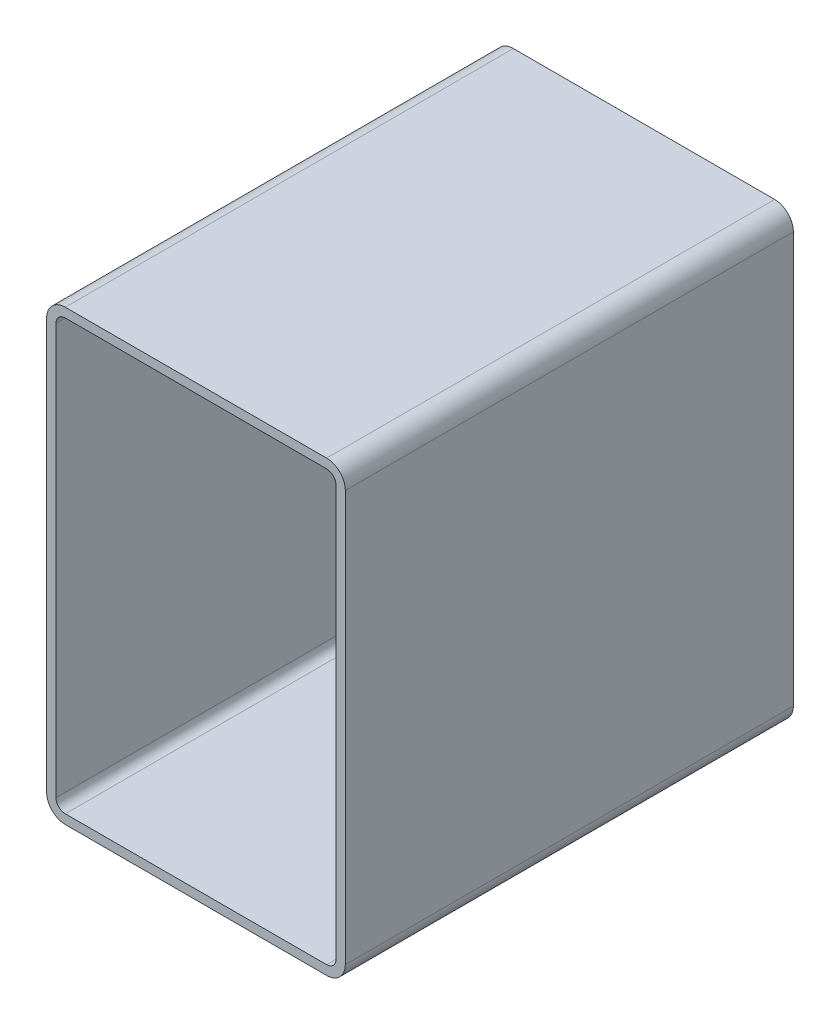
ISO-10303-21;
HEADER;
FILE_DESCRIPTION(('STEP AP214'),'2;1');
FILE_NAME('part.step','',(''),(''),'','','');
FILE_SCHEMA(('AUTOMOTIVE_DESIGN { 1 0 10303 214 1 1 1 1 }'));
ENDSEC;
DATA;
#1=APPLICATION_CONTEXT('core data for automotive mechanical design processes');
#2=APPLICATION_PROTOCOL_DEFINITION('international standard','automotive_design',2000,#1);
#3=PRODUCT_CONTEXT('',#1,'mechanical');
#4=PRODUCT('Part','Part','',(#3));
#5=PRODUCT_RELATED_PRODUCT_CATEGORY('part','',(#4));
#6=PRODUCT_DEFINITION_FORMATION('','',#4);
#7=PRODUCT_DEFINITION_CONTEXT('part definition',#1,'design');
#8=PRODUCT_DEFINITION('design','',#6,#7);
#9=PRODUCT_DEFINITION_SHAPE('','',#8);
#10=(LENGTH_UNIT() NAMED_UNIT(*) SI_UNIT(.MILLI.,.METRE.));
#11=(NAMED_UNIT(*) PLANE_ANGLE_UNIT() SI_UNIT($,.RADIAN.));
#12=(NAMED_UNIT(*) SI_UNIT($,.STERADIAN.) SOLID_ANGLE_UNIT());
#13=UNCERTAINTY_MEASURE_WITH_UNIT(LENGTH_MEASURE(1.E-05),#10,'distance_accuracy_value','');
#14=(GEOMETRIC_REPRESENTATION_CONTEXT(3) GLOBAL_UNCERTAINTY_ASSIGNED_CONTEXT((#13)) GLOBAL_UNIT_ASSIGNED_CONTEXT((#10,
#11,#12)) REPRESENTATION_CONTEXT('',''));
#15=CARTESIAN_POINT('',(0.,0.,0.));
#16=DIRECTION('',(0.,0.,1.));
#17=DIRECTION('',(1.,0.,0.));
#18=AXIS2_PLACEMENT_3D('',#15,#16,#17);
#19=CARTESIAN_POINT('',(14.0909404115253,293.974496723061,304.8));
#20=DIRECTION('',(0.,0.,1.));
#21=DIRECTION('',(1.,0.,0.));
#22=AXIS2_PLACEMENT_3D('',#19,#20,#21);
#23=PLANE('',#22);
#24=CARTESIAN_POINT('',(14.0909404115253,293.974496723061,304.8));
#25=DIRECTION('',(0.,0.,1.));
#26=DIRECTION('',(1.,0.,0.));
#27=AXIS2_PLACEMENT_3D('',#24,#25,#26);
#28=CIRCLE('',#27,12.7);
#29=CARTESIAN_POINT('',(14.0909404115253,306.674496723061,304.8));
#30=VERTEX_POINT('',#29);
#31=CARTESIAN_POINT('',(1.3909404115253,293.974496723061,304.8));
#32=VERTEX_POINT('',#31);
#33=EDGE_CURVE('E211',#30,#32,#28,.T.);
#34=ORIENTED_EDGE('',*,*,#33,.T.);
#35=DIRECTION('',(0.,-1.,0.));
#36=VECTOR('',#35,1.);
#37=CARTESIAN_POINT('',(1.3909404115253,14.5744967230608,304.8));
#38=LINE('',#37,#36);
#39=CARTESIAN_POINT('',(1.3909404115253,14.5744967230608,304.8));
#40=VERTEX_POINT('',#39);
#41=EDGE_CURVE('E214',#32,#40,#38,.T.);
#42=ORIENTED_EDGE('',*,*,#41,.T.);
#43=CARTESIAN_POINT('',(14.0909404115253,14.5744967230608,304.8));
#44=DIRECTION('',(0.,0.,1.));
#45=DIRECTION('',(1.,0.,0.));
#46=AXIS2_PLACEMENT_3D('',#43,#44,#45);
#47=CIRCLE('',#46,12.7);
#48=CARTESIAN_POINT('',(14.0909404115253,1.87449672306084,304.8));
#49=VERTEX_POINT('',#48);
#50=EDGE_CURVE('E217',#40,#49,#47,.T.);
#51=ORIENTED_EDGE('',*,*,#50,.T.);
#52=DIRECTION('',(1.,0.,0.));
#53=VECTOR('',#52,1.);
#54=CARTESIAN_POINT('',(191.890940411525,1.87449672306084,304.8));
#55=LINE('',#54,#53);
#56=CARTESIAN_POINT('',(191.890940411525,1.87449672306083,304.8));
#57=VERTEX_POINT('',#56);
#58=EDGE_CURVE('E219',#49,#57,#55,.T.);
#59=ORIENTED_EDGE('',*,*,#58,.T.);
#60=CARTESIAN_POINT('',(191.890940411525,14.5744967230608,304.8));
#61=DIRECTION('',(0.,0.,1.));
#62=DIRECTION('',(1.,0.,0.));
#63=AXIS2_PLACEMENT_3D('',#60,#61,#62);
#64=CIRCLE('',#63,12.7);
#65=CARTESIAN_POINT('',(204.590940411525,14.5744967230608,304.8));
#66=VERTEX_POINT('',#65);
#67=EDGE_CURVE('E221',#57,#66,#64,.T.);
#68=ORIENTED_EDGE('',*,*,#67,.T.);
#69=DIRECTION('',(0.,1.,0.));
#70=VECTOR('',#69,1.);
#71=CARTESIAN_POINT('',(204.590940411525,293.974496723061,304.8));
#72=LINE('',#71,#70);
#73=CARTESIAN_POINT('',(204.590940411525,293.974496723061,304.8));
#74=VERTEX_POINT('',#73);
#75=EDGE_CURVE('E223',#66,#74,#72,.T.);
#76=ORIENTED_EDGE('',*,*,#75,.T.);
#77=CARTESIAN_POINT('',(191.890940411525,293.974496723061,304.8));
#78=DIRECTION('',(0.,0.,1.));
#79=DIRECTION('',(1.,0.,0.));
#80=AXIS2_PLACEMENT_3D('',#77,#78,#79);
#81=CIRCLE('',#80,12.7);
#82=CARTESIAN_POINT('',(191.890940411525,306.674496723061,304.8));
#83=VERTEX_POINT('',#82);
#84=EDGE_CURVE('E225',#74,#83,#81,.T.);
#85=ORIENTED_EDGE('',*,*,#84,.T.);
#86=DIRECTION('',(-1.,0.,0.));
#87=VECTOR('',#86,1.);
#88=CARTESIAN_POINT('',(14.0909404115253,306.674496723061,304.8));
#89=LINE('',#88,#87);
#90=EDGE_CURVE('E227',#83,#30,#89,.T.);
#91=ORIENTED_EDGE('',*,*,#90,.T.);
#92=EDGE_LOOP('',(#34,#42,#51,#59,#68,#76,#85,#91));
#93=FACE_BOUND('',#92,.T.);
#94=DIRECTION('',(0.,-1.,0.));
#95=VECTOR('',#94,1.);
#96=CARTESIAN_POINT('',(7.7409404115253,14.5744967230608,304.8));
#97=LINE('',#96,#95);
#98=CARTESIAN_POINT('',(7.7409404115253,293.974496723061,304.8));
#99=VERTEX_POINT('',#98);
#100=CARTESIAN_POINT('',(7.7409404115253,14.5744967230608,304.8));
#101=VERTEX_POINT('',#100);
#102=EDGE_CURVE('E154',#99,#101,#97,.T.);
#103=ORIENTED_EDGE('',*,*,#102,.F.);
#104=CARTESIAN_POINT('',(14.0909404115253,293.974496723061,304.8));
#105=DIRECTION('',(0.,0.,1.));
#106=DIRECTION('',(1.,0.,0.));
#107=AXIS2_PLACEMENT_3D('',#104,#105,#106);
#108=CIRCLE('',#107,6.35000000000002);
#109=CARTESIAN_POINT('',(14.0909404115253,300.324496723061,304.8));
#110=VERTEX_POINT('',#109);
#111=EDGE_CURVE('E146',#110,#99,#108,.T.);
#112=ORIENTED_EDGE('',*,*,#111,.F.);
#113=DIRECTION('',(-1.,0.,0.));
#114=VECTOR('',#113,1.);
#115=CARTESIAN_POINT('',(14.0909404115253,300.324496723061,304.8));
#116=LINE('',#115,#114);
#117=CARTESIAN_POINT('',(191.890940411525,300.324496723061,304.8));
#118=VERTEX_POINT('',#117);
#119=EDGE_CURVE('E179',#118,#110,#116,.T.);
#120=ORIENTED_EDGE('',*,*,#119,.F.);
#121=CARTESIAN_POINT('',(191.890940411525,293.974496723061,304.8));
#122=DIRECTION('',(0.,0.,1.));
#123=DIRECTION('',(1.,0.,0.));
#124=AXIS2_PLACEMENT_3D('',#121,#122,#123);
#125=CIRCLE('',#124,6.35000000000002);
#126=CARTESIAN_POINT('',(198.240940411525,293.974496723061,304.8));
#127=VERTEX_POINT('',#126);
#128=EDGE_CURVE('E177',#127,#118,#125,.T.);
#129=ORIENTED_EDGE('',*,*,#128,.F.);
#130=DIRECTION('',(0.,1.,0.));
#131=VECTOR('',#130,1.);
#132=CARTESIAN_POINT('',(198.240940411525,293.974496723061,304.8));
#133=LINE('',#132,#131);
#134=CARTESIAN_POINT('',(198.240940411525,14.5744967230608,304.8));
#135=VERTEX_POINT('',#134);
#136=EDGE_CURVE('E175',#135,#127,#133,.T.);
#137=ORIENTED_EDGE('',*,*,#136,.F.);
#138=CARTESIAN_POINT('',(191.890940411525,14.5744967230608,304.8));
#139=DIRECTION('',(0.,0.,1.));
#140=DIRECTION('',(1.,0.,0.));
#141=AXIS2_PLACEMENT_3D('',#138,#139,#140);
#142=CIRCLE('',#141,6.35000000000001);
#143=CARTESIAN_POINT('',(191.890940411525,8.22449672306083,304.8));
#144=VERTEX_POINT('',#143);
#145=EDGE_CURVE('E173',#144,#135,#142,.T.);
#146=ORIENTED_EDGE('',*,*,#145,.F.);
#147=DIRECTION('',(1.,0.,0.));
#148=VECTOR('',#147,1.);
#149=CARTESIAN_POINT('',(191.890940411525,8.22449672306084,304.8));
#150=LINE('',#149,#148);
#151=CARTESIAN_POINT('',(14.0909404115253,8.22449672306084,304.8));
#152=VERTEX_POINT('',#151);
#153=EDGE_CURVE('E169',#152,#144,#150,.T.);
#154=ORIENTED_EDGE('',*,*,#153,.F.);
#155=CARTESIAN_POINT('',(14.0909404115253,14.5744967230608,304.8));
#156=DIRECTION('',(0.,0.,1.));
#157=DIRECTION('',(1.,0.,0.));
#158=AXIS2_PLACEMENT_3D('',#155,#156,#157);
#159=CIRCLE('',#158,6.35);
#160=EDGE_CURVE('E167',#101,#152,#159,.T.);
#161=ORIENTED_EDGE('',*,*,#160,.F.);
#162=EDGE_LOOP('',(#103,#112,#120,#129,#137,#146,#154,#161));
#163=FACE_BOUND('',#162,.T.);
#164=ADVANCED_FACE('F33',(#93,#163),#23,.T.);
#165=CARTESIAN_POINT('',(14.0909404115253,293.974496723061,0.));
#166=DIRECTION('',(0.,0.,1.));
#167=DIRECTION('',(1.,0.,0.));
#168=AXIS2_PLACEMENT_3D('',#165,#166,#167);
#169=PLANE('',#168);
#170=CARTESIAN_POINT('',(14.0909404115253,293.974496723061,0.));
#171=DIRECTION('',(0.,0.,1.));
#172=DIRECTION('',(1.,0.,0.));
#173=AXIS2_PLACEMENT_3D('',#170,#171,#172);
#174=CIRCLE('',#173,12.7);
#175=CARTESIAN_POINT('',(14.0909404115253,306.674496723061,0.));
#176=VERTEX_POINT('',#175);
#177=CARTESIAN_POINT('',(1.3909404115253,293.974496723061,0.));
#178=VERTEX_POINT('',#177);
#179=EDGE_CURVE('E162',#176,#178,#174,.T.);
#180=ORIENTED_EDGE('',*,*,#179,.F.);
#181=DIRECTION('',(-1.,0.,0.));
#182=VECTOR('',#181,1.);
#183=CARTESIAN_POINT('',(14.0909404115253,306.674496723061,0.));
#184=LINE('',#183,#182);
#185=CARTESIAN_POINT('',(191.890940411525,306.674496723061,0.));
#186=VERTEX_POINT('',#185);
#187=EDGE_CURVE('E215',#186,#176,#184,.T.);
#188=ORIENTED_EDGE('',*,*,#187,.F.);
#189=CARTESIAN_POINT('',(191.890940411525,293.974496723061,0.));
#190=DIRECTION('',(0.,0.,1.));
#191=DIRECTION('',(1.,0.,0.));
#192=AXIS2_PLACEMENT_3D('',#189,#190,#191);
#193=CIRCLE('',#192,12.7);
#194=CARTESIAN_POINT('',(204.590940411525,293.974496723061,0.));
#195=VERTEX_POINT('',#194);
#196=EDGE_CURVE('E242',#195,#186,#193,.T.);
#197=ORIENTED_EDGE('',*,*,#196,.F.);
#198=DIRECTION('',(0.,1.,0.));
#199=VECTOR('',#198,1.);
#200=CARTESIAN_POINT('',(204.590940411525,293.974496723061,0.));
#201=LINE('',#200,#199);
#202=CARTESIAN_POINT('',(204.590940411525,14.5744967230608,0.));
#203=VERTEX_POINT('',#202);
#204=EDGE_CURVE('E240',#203,#195,#201,.T.);
#205=ORIENTED_EDGE('',*,*,#204,.F.);
#206=CARTESIAN_POINT('',(191.890940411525,14.5744967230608,0.));
#207=DIRECTION('',(0.,0.,1.));
#208=DIRECTION('',(1.,0.,0.));
#209=AXIS2_PLACEMENT_3D('',#206,#207,#208);
#210=CIRCLE('',#209,12.7);
#211=CARTESIAN_POINT('',(191.890940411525,1.87449672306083,0.));
#212=VERTEX_POINT('',#211);
#213=EDGE_CURVE('E238',#212,#203,#210,.T.);
#214=ORIENTED_EDGE('',*,*,#213,.F.);
#215=DIRECTION('',(1.,0.,0.));
#216=VECTOR('',#215,1.);
#217=CARTESIAN_POINT('',(191.890940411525,1.87449672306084,0.));
#218=LINE('',#217,#216);
#219=CARTESIAN_POINT('',(14.0909404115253,1.87449672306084,0.));
#220=VERTEX_POINT('',#219);
#221=EDGE_CURVE('E236',#220,#212,#218,.T.);
#222=ORIENTED_EDGE('',*,*,#221,.F.);
#223=CARTESIAN_POINT('',(14.0909404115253,14.5744967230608,0.));
#224=DIRECTION('',(0.,0.,1.));
#225=DIRECTION('',(1.,0.,0.));
#226=AXIS2_PLACEMENT_3D('',#223,#224,#225);
#227=CIRCLE('',#226,12.7);
#228=CARTESIAN_POINT('',(1.3909404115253,14.5744967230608,0.));
#229=VERTEX_POINT('',#228);
#230=EDGE_CURVE('E234',#229,#220,#227,.T.);
#231=ORIENTED_EDGE('',*,*,#230,.F.);
#232=DIRECTION('',(0.,-1.,0.));
#233=VECTOR('',#232,1.);
#234=CARTESIAN_POINT('',(1.3909404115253,14.5744967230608,0.));
#235=LINE('',#234,#233);
#236=EDGE_CURVE('E232',#178,#229,#235,.T.);
#237=ORIENTED_EDGE('',*,*,#236,.F.);
#238=EDGE_LOOP('',(#180,#188,#197,#205,#214,#222,#231,#237));
#239=FACE_BOUND('',#238,.T.);
#240=CARTESIAN_POINT('',(14.0909404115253,293.974496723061,0.));
#241=DIRECTION('',(0.,0.,1.));
#242=DIRECTION('',(1.,0.,0.));
#243=AXIS2_PLACEMENT_3D('',#240,#241,#242);
#244=CIRCLE('',#243,6.35000000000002);
#245=CARTESIAN_POINT('',(14.0909404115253,300.324496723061,0.));
#246=VERTEX_POINT('',#245);
#247=CARTESIAN_POINT('',(7.7409404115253,293.974496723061,0.));
#248=VERTEX_POINT('',#247);
#249=EDGE_CURVE('E56',#246,#248,#244,.T.);
#250=ORIENTED_EDGE('',*,*,#249,.T.);
#251=DIRECTION('',(0.,-1.,0.));
#252=VECTOR('',#251,1.);
#253=CARTESIAN_POINT('',(7.7409404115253,14.5744967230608,0.));
#254=LINE('',#253,#252);
#255=CARTESIAN_POINT('',(7.7409404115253,14.5744967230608,0.));
#256=VERTEX_POINT('',#255);
#257=EDGE_CURVE('E161',#248,#256,#254,.T.);
#258=ORIENTED_EDGE('',*,*,#257,.T.);
#259=CARTESIAN_POINT('',(14.0909404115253,14.5744967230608,0.));
#260=DIRECTION('',(0.,0.,1.));
#261=DIRECTION('',(1.,0.,0.));
#262=AXIS2_PLACEMENT_3D('',#259,#260,#261);
#263=CIRCLE('',#262,6.35);
#264=CARTESIAN_POINT('',(14.0909404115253,8.22449672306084,0.));
#265=VERTEX_POINT('',#264);
#266=EDGE_CURVE('E183',#256,#265,#263,.T.);
#267=ORIENTED_EDGE('',*,*,#266,.T.);
#268=DIRECTION('',(1.,0.,0.));
#269=VECTOR('',#268,1.);
#270=CARTESIAN_POINT('',(191.890940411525,8.22449672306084,0.));
#271=LINE('',#270,#269);
#272=CARTESIAN_POINT('',(191.890940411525,8.22449672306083,0.));
#273=VERTEX_POINT('',#272);
#274=EDGE_CURVE('E186',#265,#273,#271,.T.);
#275=ORIENTED_EDGE('',*,*,#274,.T.);
#276=CARTESIAN_POINT('',(191.890940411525,14.5744967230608,0.));
#277=DIRECTION('',(0.,0.,1.));
#278=DIRECTION('',(1.,0.,0.));
#279=AXIS2_PLACEMENT_3D('',#276,#277,#278);
#280=CIRCLE('',#279,6.35000000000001);
#281=CARTESIAN_POINT('',(198.240940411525,14.5744967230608,0.));
#282=VERTEX_POINT('',#281);
#283=EDGE_CURVE('E189',#273,#282,#280,.T.);
#284=ORIENTED_EDGE('',*,*,#283,.T.);
#285=DIRECTION('',(0.,1.,0.));
#286=VECTOR('',#285,1.);
#287=CARTESIAN_POINT('',(198.240940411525,293.974496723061,0.));
#288=LINE('',#287,#286);
#289=CARTESIAN_POINT('',(198.240940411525,293.974496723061,0.));
#290=VERTEX_POINT('',#289);
#291=EDGE_CURVE('E192',#282,#290,#288,.T.);
#292=ORIENTED_EDGE('',*,*,#291,.T.);
#293=CARTESIAN_POINT('',(191.890940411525,293.974496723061,0.));
#294=DIRECTION('',(0.,0.,1.));
#295=DIRECTION('',(1.,0.,0.));
#296=AXIS2_PLACEMENT_3D('',#293,#294,#295);
#297=CIRCLE('',#296,6.35000000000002);
#298=CARTESIAN_POINT('',(191.890940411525,300.324496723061,0.));
#299=VERTEX_POINT('',#298);
#300=EDGE_CURVE('E195',#290,#299,#297,.T.);
#301=ORIENTED_EDGE('',*,*,#300,.T.);
#302=DIRECTION('',(-1.,0.,0.));
#303=VECTOR('',#302,1.);
#304=CARTESIAN_POINT('',(14.0909404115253,300.324496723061,0.));
#305=LINE('',#304,#303);
#306=EDGE_CURVE('E155',#299,#246,#305,.T.);
#307=ORIENTED_EDGE('',*,*,#306,.T.);
#308=EDGE_LOOP('',(#250,#258,#267,#275,#284,#292,#301,#307));
#309=FACE_BOUND('',#308,.T.);
#310=ADVANCED_FACE('F272',(#239,#309),#169,.F.);
#311=CARTESIAN_POINT('',(14.0909404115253,293.974496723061,304.8));
#312=DIRECTION('',(0.,0.,-1.));
#313=DIRECTION('',(-1.,0.,0.));
#314=AXIS2_PLACEMENT_3D('',#311,#312,#313);
#315=CYLINDRICAL_SURFACE('',#314,12.7);
#316=ORIENTED_EDGE('',*,*,#179,.T.);
#317=DIRECTION('',(0.,0.,-1.));
#318=VECTOR('',#317,1.);
#319=CARTESIAN_POINT('',(1.3909404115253,293.974496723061,304.8));
#320=LINE('',#319,#318);
#321=EDGE_CURVE('E11',#32,#178,#320,.T.);
#322=ORIENTED_EDGE('',*,*,#321,.F.);
#323=ORIENTED_EDGE('',*,*,#33,.F.);
#324=DIRECTION('',(0.,0.,-1.));
#325=VECTOR('',#324,1.);
#326=CARTESIAN_POINT('',(14.0909404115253,306.674496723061,304.8));
#327=LINE('',#326,#325);
#328=EDGE_CURVE('E229',#30,#176,#327,.T.);
#329=ORIENTED_EDGE('',*,*,#328,.T.);
#330=EDGE_LOOP('',(#316,#322,#323,#329));
#331=FACE_BOUND('',#330,.T.);
#332=ADVANCED_FACE('F35',(#331),#315,.T.);
#333=CARTESIAN_POINT('',(1.3909404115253,14.5744967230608,304.8));
#334=DIRECTION('',(1.,0.,0.));
#335=DIRECTION('',(0.,0.,-1.));
#336=AXIS2_PLACEMENT_3D('',#333,#334,#335);
#337=PLANE('',#336);
#338=ORIENTED_EDGE('',*,*,#236,.T.);
#339=DIRECTION('',(0.,0.,-1.));
#340=VECTOR('',#339,1.);
#341=CARTESIAN_POINT('',(1.3909404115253,14.5744967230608,304.8));
#342=LINE('',#341,#340);
#343=EDGE_CURVE('E41',#40,#229,#342,.T.);
#344=ORIENTED_EDGE('',*,*,#343,.F.);
#345=ORIENTED_EDGE('',*,*,#41,.F.);
#346=ORIENTED_EDGE('',*,*,#321,.T.);
#347=EDGE_LOOP('',(#338,#344,#345,#346));
#348=FACE_BOUND('',#347,.T.);
#349=ADVANCED_FACE('F289',(#348),#337,.F.);
#350=CARTESIAN_POINT('',(14.0909404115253,14.5744967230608,304.8));
#351=DIRECTION('',(0.,0.,-1.));
#352=DIRECTION('',(-1.,0.,0.));
#353=AXIS2_PLACEMENT_3D('',#350,#351,#352);
#354=CYLINDRICAL_SURFACE('',#353,12.7);
#355=ORIENTED_EDGE('',*,*,#230,.T.);
#356=DIRECTION('',(0.,0.,-1.));
#357=VECTOR('',#356,1.);
#358=CARTESIAN_POINT('',(14.0909404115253,1.87449672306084,304.8));
#359=LINE('',#358,#357);
#360=EDGE_CURVE('E259',#49,#220,#359,.T.);
#361=ORIENTED_EDGE('',*,*,#360,.F.);
#362=ORIENTED_EDGE('',*,*,#50,.F.);
#363=ORIENTED_EDGE('',*,*,#343,.T.);
#364=EDGE_LOOP('',(#355,#361,#362,#363));
#365=FACE_BOUND('',#364,.T.);
#366=ADVANCED_FACE('F266',(#365),#354,.T.);
#367=CARTESIAN_POINT('',(191.890940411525,1.87449672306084,304.8));
#368=DIRECTION('',(0.,1.,0.));
#369=DIRECTION('',(0.,0.,1.));
#370=AXIS2_PLACEMENT_3D('',#367,#368,#369);
#371=PLANE('',#370);
#372=ORIENTED_EDGE('',*,*,#221,.T.);
#373=DIRECTION('',(0.,0.,-1.));
#374=VECTOR('',#373,1.);
#375=CARTESIAN_POINT('',(191.890940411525,1.87449672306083,304.8));
#376=LINE('',#375,#374);
#377=EDGE_CURVE('E256',#57,#212,#376,.T.);
#378=ORIENTED_EDGE('',*,*,#377,.F.);
#379=ORIENTED_EDGE('',*,*,#58,.F.);
#380=ORIENTED_EDGE('',*,*,#360,.T.);
#381=EDGE_LOOP('',(#372,#378,#379,#380));
#382=FACE_BOUND('',#381,.T.);
#383=ADVANCED_FACE('F278',(#382),#371,.F.);
#384=CARTESIAN_POINT('',(191.890940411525,14.5744967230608,304.8));
#385=DIRECTION('',(0.,0.,-1.));
#386=DIRECTION('',(-1.,0.,0.));
#387=AXIS2_PLACEMENT_3D('',#384,#385,#386);
#388=CYLINDRICAL_SURFACE('',#387,12.7);
#389=ORIENTED_EDGE('',*,*,#213,.T.);
#390=DIRECTION('',(0.,0.,-1.));
#391=VECTOR('',#390,1.);
#392=CARTESIAN_POINT('',(204.590940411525,14.5744967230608,304.8));
#393=LINE('',#392,#391);
#394=EDGE_CURVE('E253',#66,#203,#393,.T.);
#395=ORIENTED_EDGE('',*,*,#394,.F.);
#396=ORIENTED_EDGE('',*,*,#67,.F.);
#397=ORIENTED_EDGE('',*,*,#377,.T.);
#398=EDGE_LOOP('',(#389,#395,#396,#397));
#399=FACE_BOUND('',#398,.T.);
#400=ADVANCED_FACE('F282',(#399),#388,.T.);
#401=CARTESIAN_POINT('',(204.590940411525,293.974496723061,304.8));
#402=DIRECTION('',(-1.,0.,0.));
#403=DIRECTION('',(0.,0.,1.));
#404=AXIS2_PLACEMENT_3D('',#401,#402,#403);
#405=PLANE('',#404);
#406=ORIENTED_EDGE('',*,*,#204,.T.);
#407=DIRECTION('',(0.,0.,-1.));
#408=VECTOR('',#407,1.);
#409=CARTESIAN_POINT('',(204.590940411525,293.974496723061,304.8));
#410=LINE('',#409,#408);
#411=EDGE_CURVE('E250',#74,#195,#410,.T.);
#412=ORIENTED_EDGE('',*,*,#411,.F.);
#413=ORIENTED_EDGE('',*,*,#75,.F.);
#414=ORIENTED_EDGE('',*,*,#394,.T.);
#415=EDGE_LOOP('',(#406,#412,#413,#414));
#416=FACE_BOUND('',#415,.T.);
#417=ADVANCED_FACE('F302',(#416),#405,.F.);
#418=CARTESIAN_POINT('',(191.890940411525,293.974496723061,304.8));
#419=DIRECTION('',(0.,0.,-1.));
#420=DIRECTION('',(-1.,0.,0.));
#421=AXIS2_PLACEMENT_3D('',#418,#419,#420);
#422=CYLINDRICAL_SURFACE('',#421,12.7);
#423=ORIENTED_EDGE('',*,*,#196,.T.);
#424=DIRECTION('',(0.,0.,-1.));
#425=VECTOR('',#424,1.);
#426=CARTESIAN_POINT('',(191.890940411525,306.674496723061,304.8));
#427=LINE('',#426,#425);
#428=EDGE_CURVE('E247',#83,#186,#427,.T.);
#429=ORIENTED_EDGE('',*,*,#428,.F.);
#430=ORIENTED_EDGE('',*,*,#84,.F.);
#431=ORIENTED_EDGE('',*,*,#411,.T.);
#432=EDGE_LOOP('',(#423,#429,#430,#431));
#433=FACE_BOUND('',#432,.T.);
#434=ADVANCED_FACE('F300',(#433),#422,.T.);
#435=CARTESIAN_POINT('',(14.0909404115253,306.674496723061,304.8));
#436=DIRECTION('',(0.,-1.,0.));
#437=DIRECTION('',(0.,0.,-1.));
#438=AXIS2_PLACEMENT_3D('',#435,#436,#437);
#439=PLANE('',#438);
#440=ORIENTED_EDGE('',*,*,#187,.T.);
#441=ORIENTED_EDGE('',*,*,#328,.F.);
#442=ORIENTED_EDGE('',*,*,#90,.F.);
#443=ORIENTED_EDGE('',*,*,#428,.T.);
#444=EDGE_LOOP('',(#440,#441,#442,#443));
#445=FACE_BOUND('',#444,.T.);
#446=ADVANCED_FACE('F295',(#445),#439,.F.);
#447=CARTESIAN_POINT('',(14.0909404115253,293.974496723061,304.8));
#448=DIRECTION('',(0.,0.,-1.));
#449=DIRECTION('',(-1.,0.,0.));
#450=AXIS2_PLACEMENT_3D('',#447,#448,#449);
#451=CYLINDRICAL_SURFACE('',#450,6.35000000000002);
#452=ORIENTED_EDGE('',*,*,#249,.F.);
#453=DIRECTION('',(0.,0.,-1.));
#454=VECTOR('',#453,1.);
#455=CARTESIAN_POINT('',(14.0909404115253,300.324496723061,304.8));
#456=LINE('',#455,#454);
#457=EDGE_CURVE('E150',#110,#246,#456,.T.);
#458=ORIENTED_EDGE('',*,*,#457,.F.);
#459=ORIENTED_EDGE('',*,*,#111,.T.);
#460=DIRECTION('',(0.,0.,-1.));
#461=VECTOR('',#460,1.);
#462=CARTESIAN_POINT('',(7.7409404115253,293.974496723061,304.8));
#463=LINE('',#462,#461);
#464=EDGE_CURVE('E149',#99,#248,#463,.T.);
#465=ORIENTED_EDGE('',*,*,#464,.T.);
#466=EDGE_LOOP('',(#452,#458,#459,#465));
#467=FACE_BOUND('',#466,.T.);
#468=ADVANCED_FACE('F148',(#467),#451,.F.);
#469=CARTESIAN_POINT('',(7.7409404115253,14.5744967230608,304.8));
#470=DIRECTION('',(1.,0.,0.));
#471=DIRECTION('',(0.,0.,-1.));
#472=AXIS2_PLACEMENT_3D('',#469,#470,#471);
#473=PLANE('',#472);
#474=ORIENTED_EDGE('',*,*,#257,.F.);
#475=ORIENTED_EDGE('',*,*,#464,.F.);
#476=ORIENTED_EDGE('',*,*,#102,.T.);
#477=DIRECTION('',(0.,0.,-1.));
#478=VECTOR('',#477,1.);
#479=CARTESIAN_POINT('',(7.7409404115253,14.5744967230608,304.8));
#480=LINE('',#479,#478);
#481=EDGE_CURVE('E163',#101,#256,#480,.T.);
#482=ORIENTED_EDGE('',*,*,#481,.T.);
#483=EDGE_LOOP('',(#474,#475,#476,#482));
#484=FACE_BOUND('',#483,.T.);
#485=ADVANCED_FACE('F158',(#484),#473,.T.);
#486=CARTESIAN_POINT('',(14.0909404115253,14.5744967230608,304.8));
#487=DIRECTION('',(0.,0.,-1.));
#488=DIRECTION('',(-1.,0.,0.));
#489=AXIS2_PLACEMENT_3D('',#486,#487,#488);
#490=CYLINDRICAL_SURFACE('',#489,6.35);
#491=ORIENTED_EDGE('',*,*,#266,.F.);
#492=ORIENTED_EDGE('',*,*,#481,.F.);
#493=ORIENTED_EDGE('',*,*,#160,.T.);
#494=DIRECTION('',(0.,0.,-1.));
#495=VECTOR('',#494,1.);
#496=CARTESIAN_POINT('',(14.0909404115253,8.22449672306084,304.8));
#497=LINE('',#496,#495);
#498=EDGE_CURVE('E208',#152,#265,#497,.T.);
#499=ORIENTED_EDGE('',*,*,#498,.T.);
#500=EDGE_LOOP('',(#491,#492,#493,#499));
#501=FACE_BOUND('',#500,.T.);
#502=ADVANCED_FACE('F327',(#501),#490,.F.);
#503=CARTESIAN_POINT('',(191.890940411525,8.22449672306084,304.8));
#504=DIRECTION('',(0.,1.,0.));
#505=DIRECTION('',(0.,0.,1.));
#506=AXIS2_PLACEMENT_3D('',#503,#504,#505);
#507=PLANE('',#506);
#508=ORIENTED_EDGE('',*,*,#274,.F.);
#509=ORIENTED_EDGE('',*,*,#498,.F.);
#510=ORIENTED_EDGE('',*,*,#153,.T.);
#511=DIRECTION('',(0.,0.,-1.));
#512=VECTOR('',#511,1.);
#513=CARTESIAN_POINT('',(191.890940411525,8.22449672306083,304.8));
#514=LINE('',#513,#512);
#515=EDGE_CURVE('E206',#144,#273,#514,.T.);
#516=ORIENTED_EDGE('',*,*,#515,.T.);
#517=EDGE_LOOP('',(#508,#509,#510,#516));
#518=FACE_BOUND('',#517,.T.);
#519=ADVANCED_FACE('F331',(#518),#507,.T.);
#520=CARTESIAN_POINT('',(191.890940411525,14.5744967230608,304.8));
#521=DIRECTION('',(0.,0.,-1.));
#522=DIRECTION('',(-1.,0.,0.));
#523=AXIS2_PLACEMENT_3D('',#520,#521,#522);
#524=CYLINDRICAL_SURFACE('',#523,6.35000000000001);
#525=ORIENTED_EDGE('',*,*,#283,.F.);
#526=ORIENTED_EDGE('',*,*,#515,.F.);
#527=ORIENTED_EDGE('',*,*,#145,.T.);
#528=DIRECTION('',(0.,0.,-1.));
#529=VECTOR('',#528,1.);
#530=CARTESIAN_POINT('',(198.240940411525,14.5744967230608,304.8));
#531=LINE('',#530,#529);
#532=EDGE_CURVE('E204',#135,#282,#531,.T.);
#533=ORIENTED_EDGE('',*,*,#532,.T.);
#534=EDGE_LOOP('',(#525,#526,#527,#533));
#535=FACE_BOUND('',#534,.T.);
#536=ADVANCED_FACE('F337',(#535),#524,.F.);
#537=CARTESIAN_POINT('',(198.240940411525,293.974496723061,304.8));
#538=DIRECTION('',(-1.,0.,0.));
#539=DIRECTION('',(0.,0.,1.));
#540=AXIS2_PLACEMENT_3D('',#537,#538,#539);
#541=PLANE('',#540);
#542=ORIENTED_EDGE('',*,*,#291,.F.);
#543=ORIENTED_EDGE('',*,*,#532,.F.);
#544=ORIENTED_EDGE('',*,*,#136,.T.);
#545=DIRECTION('',(0.,0.,-1.));
#546=VECTOR('',#545,1.);
#547=CARTESIAN_POINT('',(198.240940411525,293.974496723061,304.8));
#548=LINE('',#547,#546);
#549=EDGE_CURVE('E202',#127,#290,#548,.T.);
#550=ORIENTED_EDGE('',*,*,#549,.T.);
#551=EDGE_LOOP('',(#542,#543,#544,#550));
#552=FACE_BOUND('',#551,.T.);
#553=ADVANCED_FACE('F341',(#552),#541,.T.);
#554=CARTESIAN_POINT('',(191.890940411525,293.974496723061,304.8));
#555=DIRECTION('',(0.,0.,-1.));
#556=DIRECTION('',(-1.,0.,0.));
#557=AXIS2_PLACEMENT_3D('',#554,#555,#556);
#558=CYLINDRICAL_SURFACE('',#557,6.35000000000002);
#559=ORIENTED_EDGE('',*,*,#300,.F.);
#560=ORIENTED_EDGE('',*,*,#549,.F.);
#561=ORIENTED_EDGE('',*,*,#128,.T.);
#562=DIRECTION('',(0.,0.,-1.));
#563=VECTOR('',#562,1.);
#564=CARTESIAN_POINT('',(191.890940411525,300.324496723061,304.8));
#565=LINE('',#564,#563);
#566=EDGE_CURVE('E48',#118,#299,#565,.T.);
#567=ORIENTED_EDGE('',*,*,#566,.T.);
#568=EDGE_LOOP('',(#559,#560,#561,#567));
#569=FACE_BOUND('',#568,.T.);
#570=ADVANCED_FACE('F345',(#569),#558,.F.);
#571=CARTESIAN_POINT('',(14.0909404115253,300.324496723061,304.8));
#572=DIRECTION('',(0.,-1.,0.));
#573=DIRECTION('',(0.,0.,-1.));
#574=AXIS2_PLACEMENT_3D('',#571,#572,#573);
#575=PLANE('',#574);
#576=ORIENTED_EDGE('',*,*,#306,.F.);
#577=ORIENTED_EDGE('',*,*,#566,.F.);
#578=ORIENTED_EDGE('',*,*,#119,.T.);
#579=ORIENTED_EDGE('',*,*,#457,.T.);
#580=EDGE_LOOP('',(#576,#577,#578,#579));
#581=FACE_BOUND('',#580,.T.);
#582=ADVANCED_FACE('F349',(#581),#575,.T.);
#583=CLOSED_SHELL('',(#164,#310,#332,#349,#366,#383,#400,#417,#434,#446,#468,#485,#502,#519,
#536,#553,#570,#582));
#584=MANIFOLD_SOLID_BREP('B2',#583);
#585=ADVANCED_BREP_SHAPE_REPRESENTATION('',(#18,#584),#14);
#586=SHAPE_DEFINITION_REPRESENTATION(#9,#585);
ENDSEC;
END-ISO-10303-21;
